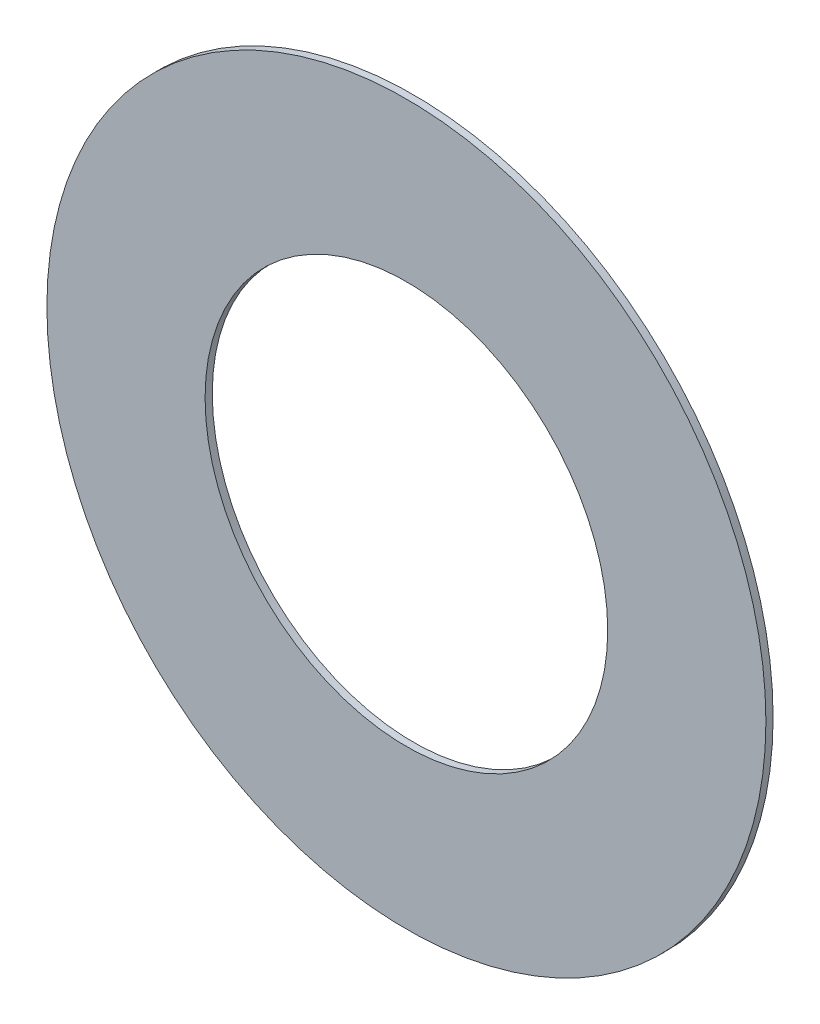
ISO-10303-21;
HEADER;
FILE_DESCRIPTION(('STEP AP214'),'2;1');
FILE_NAME('part.step','',(''),(''),'','','');
FILE_SCHEMA(('AUTOMOTIVE_DESIGN { 1 0 10303 214 1 1 1 1 }'));
ENDSEC;
DATA;
#1=APPLICATION_CONTEXT('core data for automotive mechanical design processes');
#2=APPLICATION_PROTOCOL_DEFINITION('international standard','automotive_design',2000,#1);
#3=PRODUCT_CONTEXT('',#1,'mechanical');
#4=PRODUCT('Part','Part','',(#3));
#5=PRODUCT_RELATED_PRODUCT_CATEGORY('part','',(#4));
#6=PRODUCT_DEFINITION_FORMATION('','',#4);
#7=PRODUCT_DEFINITION_CONTEXT('part definition',#1,'design');
#8=PRODUCT_DEFINITION('design','',#6,#7);
#9=PRODUCT_DEFINITION_SHAPE('','',#8);
#10=(LENGTH_UNIT() NAMED_UNIT(*) SI_UNIT(.MILLI.,.METRE.));
#11=(NAMED_UNIT(*) PLANE_ANGLE_UNIT() SI_UNIT($,.RADIAN.));
#12=(NAMED_UNIT(*) SI_UNIT($,.STERADIAN.) SOLID_ANGLE_UNIT());
#13=UNCERTAINTY_MEASURE_WITH_UNIT(LENGTH_MEASURE(1.E-05),#10,'distance_accuracy_value','');
#14=(GEOMETRIC_REPRESENTATION_CONTEXT(3) GLOBAL_UNCERTAINTY_ASSIGNED_CONTEXT((#13)) GLOBAL_UNIT_ASSIGNED_CONTEXT((#10,
#11,#12)) REPRESENTATION_CONTEXT('',''));
#15=CARTESIAN_POINT('',(0.,0.,0.));
#16=DIRECTION('',(0.,0.,1.));
#17=DIRECTION('',(1.,0.,0.));
#18=AXIS2_PLACEMENT_3D('',#15,#16,#17);
#19=CARTESIAN_POINT('',(0.,0.,0.750000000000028));
#20=DIRECTION('',(0.,0.,1.));
#21=DIRECTION('',(1.,0.,0.));
#22=AXIS2_PLACEMENT_3D('',#19,#20,#21);
#23=PLANE('',#22);
#24=CARTESIAN_POINT('',(0.,0.,0.750000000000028));
#25=DIRECTION('',(0.,0.,1.));
#26=DIRECTION('',(1.,0.,0.));
#27=AXIS2_PLACEMENT_3D('',#24,#25,#26);
#28=CIRCLE('',#27,37.5);
#29=CARTESIAN_POINT('',(37.5,0.,0.750000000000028));
#30=VERTEX_POINT('',#29);
#31=EDGE_CURVE('E10',#30,#30,#28,.T.);
#32=ORIENTED_EDGE('',*,*,#31,.T.);
#33=EDGE_LOOP('',(#32));
#34=FACE_BOUND('',#33,.T.);
#35=CARTESIAN_POINT('',(0.,0.,0.750000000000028));
#36=DIRECTION('',(0.,0.,1.));
#37=DIRECTION('',(1.,0.,0.));
#38=AXIS2_PLACEMENT_3D('',#35,#36,#37);
#39=CIRCLE('',#38,21.);
#40=CARTESIAN_POINT('',(21.,0.,0.750000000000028));
#41=VERTEX_POINT('',#40);
#42=EDGE_CURVE('E44',#41,#41,#39,.T.);
#43=ORIENTED_EDGE('',*,*,#42,.F.);
#44=EDGE_LOOP('',(#43));
#45=FACE_BOUND('',#44,.T.);
#46=ADVANCED_FACE('F33',(#34,#45),#23,.T.);
#47=CARTESIAN_POINT('',(0.,0.,0.));
#48=DIRECTION('',(0.,0.,1.));
#49=DIRECTION('',(1.,0.,0.));
#50=AXIS2_PLACEMENT_3D('',#47,#48,#49);
#51=PLANE('',#50);
#52=CARTESIAN_POINT('',(0.,0.,0.));
#53=DIRECTION('',(0.,0.,1.));
#54=DIRECTION('',(1.,0.,0.));
#55=AXIS2_PLACEMENT_3D('',#52,#53,#54);
#56=CIRCLE('',#55,37.5);
#57=CARTESIAN_POINT('',(37.5,0.,0.));
#58=VERTEX_POINT('',#57);
#59=EDGE_CURVE('E40',#58,#58,#56,.T.);
#60=ORIENTED_EDGE('',*,*,#59,.F.);
#61=EDGE_LOOP('',(#60));
#62=FACE_BOUND('',#61,.T.);
#63=CARTESIAN_POINT('',(0.,0.,0.));
#64=DIRECTION('',(0.,0.,1.));
#65=DIRECTION('',(1.,0.,0.));
#66=AXIS2_PLACEMENT_3D('',#63,#64,#65);
#67=CIRCLE('',#66,21.);
#68=CARTESIAN_POINT('',(21.,0.,0.));
#69=VERTEX_POINT('',#68);
#70=EDGE_CURVE('E48',#69,#69,#67,.T.);
#71=ORIENTED_EDGE('',*,*,#70,.T.);
#72=EDGE_LOOP('',(#71));
#73=FACE_BOUND('',#72,.T.);
#74=ADVANCED_FACE('F54',(#62,#73),#51,.F.);
#75=CARTESIAN_POINT('',(0.,0.,0.750000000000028));
#76=DIRECTION('',(0.,0.,-1.));
#77=DIRECTION('',(-1.,0.,0.));
#78=AXIS2_PLACEMENT_3D('',#75,#76,#77);
#79=CYLINDRICAL_SURFACE('',#78,37.5);
#80=ORIENTED_EDGE('',*,*,#31,.F.);
#81=EDGE_LOOP('',(#80));
#82=FACE_BOUND('',#81,.T.);
#83=ORIENTED_EDGE('',*,*,#59,.T.);
#84=EDGE_LOOP('',(#83));
#85=FACE_BOUND('',#84,.T.);
#86=ADVANCED_FACE('F35',(#82,#85),#79,.T.);
#87=CARTESIAN_POINT('',(0.,0.,0.750000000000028));
#88=DIRECTION('',(0.,0.,-1.));
#89=DIRECTION('',(-1.,0.,0.));
#90=AXIS2_PLACEMENT_3D('',#87,#88,#89);
#91=CYLINDRICAL_SURFACE('',#90,21.);
#92=ORIENTED_EDGE('',*,*,#42,.T.);
#93=EDGE_LOOP('',(#92));
#94=FACE_BOUND('',#93,.T.);
#95=ORIENTED_EDGE('',*,*,#70,.F.);
#96=EDGE_LOOP('',(#95));
#97=FACE_BOUND('',#96,.T.);
#98=ADVANCED_FACE('F56',(#94,#97),#91,.F.);
#99=CLOSED_SHELL('',(#46,#74,#86,#98));
#100=MANIFOLD_SOLID_BREP('B2',#99);
#101=ADVANCED_BREP_SHAPE_REPRESENTATION('',(#18,#100),#14);
#102=SHAPE_DEFINITION_REPRESENTATION(#9,#101);
ENDSEC;
END-ISO-10303-21;
